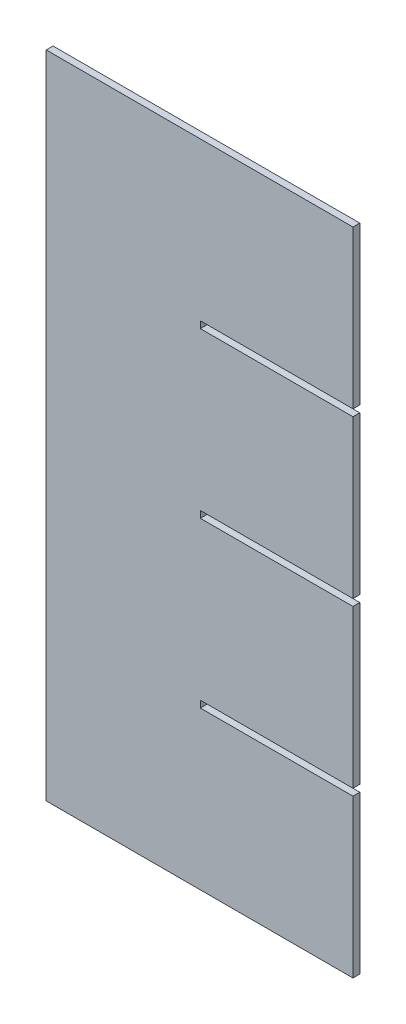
ISO-10303-21;
HEADER;
FILE_DESCRIPTION(('STEP AP214'),'2;1');
FILE_NAME('part.step','',(''),(''),'','','');
FILE_SCHEMA(('AUTOMOTIVE_DESIGN { 1 0 10303 214 1 1 1 1 }'));
ENDSEC;
DATA;
#1=APPLICATION_CONTEXT('core data for automotive mechanical design processes');
#2=APPLICATION_PROTOCOL_DEFINITION('international standard','automotive_design',2000,#1);
#3=PRODUCT_CONTEXT('',#1,'mechanical');
#4=PRODUCT('Part','Part','',(#3));
#5=PRODUCT_RELATED_PRODUCT_CATEGORY('part','',(#4));
#6=PRODUCT_DEFINITION_FORMATION('','',#4);
#7=PRODUCT_DEFINITION_CONTEXT('part definition',#1,'design');
#8=PRODUCT_DEFINITION('design','',#6,#7);
#9=PRODUCT_DEFINITION_SHAPE('','',#8);
#10=(LENGTH_UNIT() NAMED_UNIT(*) SI_UNIT(.MILLI.,.METRE.));
#11=(NAMED_UNIT(*) PLANE_ANGLE_UNIT() SI_UNIT($,.RADIAN.));
#12=(NAMED_UNIT(*) SI_UNIT($,.STERADIAN.) SOLID_ANGLE_UNIT());
#13=UNCERTAINTY_MEASURE_WITH_UNIT(LENGTH_MEASURE(1.E-05),#10,'distance_accuracy_value','');
#14=(GEOMETRIC_REPRESENTATION_CONTEXT(3) GLOBAL_UNCERTAINTY_ASSIGNED_CONTEXT((#13)) GLOBAL_UNIT_ASSIGNED_CONTEXT((#10,
#11,#12)) REPRESENTATION_CONTEXT('',''));
#15=CARTESIAN_POINT('',(0.,0.,0.));
#16=DIRECTION('',(0.,0.,1.));
#17=DIRECTION('',(1.,0.,0.));
#18=AXIS2_PLACEMENT_3D('',#15,#16,#17);
#19=CARTESIAN_POINT('',(6.10622663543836E-13,339.852,3.556));
#20=DIRECTION('',(1.,0.,0.));
#21=DIRECTION('',(0.,1.,0.));
#22=AXIS2_PLACEMENT_3D('',#19,#20,#21);
#23=PLANE('',#22);
#24=DIRECTION('',(0.,-1.,0.));
#25=VECTOR('',#24,1.);
#26=CARTESIAN_POINT('',(6.10622663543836E-13,339.852,0.));
#27=LINE('',#26,#25);
#28=CARTESIAN_POINT('',(6.10622663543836E-13,339.852,0.));
#29=VERTEX_POINT('',#28);
#30=CARTESIAN_POINT('',(0.,0.,0.));
#31=VERTEX_POINT('',#30);
#32=EDGE_CURVE('E177',#29,#31,#27,.T.);
#33=ORIENTED_EDGE('',*,*,#32,.T.);
#34=DIRECTION('',(0.,0.,-1.));
#35=VECTOR('',#34,1.);
#36=CARTESIAN_POINT('',(0.,0.,3.556));
#37=LINE('',#36,#35);
#38=CARTESIAN_POINT('',(0.,0.,3.556));
#39=VERTEX_POINT('',#38);
#40=EDGE_CURVE('E11',#39,#31,#37,.T.);
#41=ORIENTED_EDGE('',*,*,#40,.F.);
#42=DIRECTION('',(0.,-1.,0.));
#43=VECTOR('',#42,1.);
#44=CARTESIAN_POINT('',(6.10622663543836E-13,339.852,3.556));
#45=LINE('',#44,#43);
#46=CARTESIAN_POINT('',(6.10622663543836E-13,339.852,3.556));
#47=VERTEX_POINT('',#46);
#48=EDGE_CURVE('E207',#47,#39,#45,.T.);
#49=ORIENTED_EDGE('',*,*,#48,.F.);
#50=DIRECTION('',(0.,0.,-1.));
#51=VECTOR('',#50,1.);
#52=CARTESIAN_POINT('',(6.10622663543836E-13,339.852,3.556));
#53=LINE('',#52,#51);
#54=EDGE_CURVE('E173',#47,#29,#53,.T.);
#55=ORIENTED_EDGE('',*,*,#54,.T.);
#56=EDGE_LOOP('',(#33,#41,#49,#55));
#57=FACE_BOUND('',#56,.T.);
#58=ADVANCED_FACE('F33',(#57),#23,.F.);
#59=CARTESIAN_POINT('',(0.,0.,3.556));
#60=DIRECTION('',(0.,1.,0.));
#61=DIRECTION('',(0.,0.,1.));
#62=AXIS2_PLACEMENT_3D('',#59,#60,#61);
#63=PLANE('',#62);
#64=DIRECTION('',(1.,0.,0.));
#65=VECTOR('',#64,1.);
#66=CARTESIAN_POINT('',(0.,0.,0.));
#67=LINE('',#66,#65);
#68=CARTESIAN_POINT('',(160.274,0.,0.));
#69=VERTEX_POINT('',#68);
#70=EDGE_CURVE('E180',#31,#69,#67,.T.);
#71=ORIENTED_EDGE('',*,*,#70,.T.);
#72=DIRECTION('',(0.,0.,-1.));
#73=VECTOR('',#72,1.);
#74=CARTESIAN_POINT('',(160.274,0.,3.556));
#75=LINE('',#74,#73);
#76=CARTESIAN_POINT('',(160.274,0.,3.556));
#77=VERTEX_POINT('',#76);
#78=EDGE_CURVE('E41',#77,#69,#75,.T.);
#79=ORIENTED_EDGE('',*,*,#78,.F.);
#80=DIRECTION('',(1.,0.,0.));
#81=VECTOR('',#80,1.);
#82=CARTESIAN_POINT('',(0.,0.,3.556));
#83=LINE('',#82,#81);
#84=EDGE_CURVE('E116',#39,#77,#83,.T.);
#85=ORIENTED_EDGE('',*,*,#84,.F.);
#86=ORIENTED_EDGE('',*,*,#40,.T.);
#87=EDGE_LOOP('',(#71,#79,#85,#86));
#88=FACE_BOUND('',#87,.T.);
#89=ADVANCED_FACE('F305',(#88),#63,.F.);
#90=CARTESIAN_POINT('',(160.274,0.,3.556));
#91=DIRECTION('',(-1.,0.,0.));
#92=DIRECTION('',(0.,0.,1.));
#93=AXIS2_PLACEMENT_3D('',#90,#91,#92);
#94=PLANE('',#93);
#95=DIRECTION('',(0.,1.,0.));
#96=VECTOR('',#95,1.);
#97=CARTESIAN_POINT('',(160.274,0.,0.));
#98=LINE('',#97,#96);
#99=CARTESIAN_POINT('',(160.274,82.296,0.));
#100=VERTEX_POINT('',#99);
#101=EDGE_CURVE('E182',#69,#100,#98,.T.);
#102=ORIENTED_EDGE('',*,*,#101,.T.);
#103=DIRECTION('',(0.,0.,-1.));
#104=VECTOR('',#103,1.);
#105=CARTESIAN_POINT('',(160.274,82.296,3.556));
#106=LINE('',#105,#104);
#107=CARTESIAN_POINT('',(160.274,82.296,3.556));
#108=VERTEX_POINT('',#107);
#109=EDGE_CURVE('E238',#108,#100,#106,.T.);
#110=ORIENTED_EDGE('',*,*,#109,.F.);
#111=DIRECTION('',(0.,1.,0.));
#112=VECTOR('',#111,1.);
#113=CARTESIAN_POINT('',(160.274,0.,3.556));
#114=LINE('',#113,#112);
#115=EDGE_CURVE('E246',#77,#108,#114,.T.);
#116=ORIENTED_EDGE('',*,*,#115,.F.);
#117=ORIENTED_EDGE('',*,*,#78,.T.);
#118=EDGE_LOOP('',(#102,#110,#116,#117));
#119=FACE_BOUND('',#118,.T.);
#120=ADVANCED_FACE('F244',(#119),#94,.F.);
#121=CARTESIAN_POINT('',(160.274,82.296,3.556));
#122=DIRECTION('',(0.,-1.,0.));
#123=DIRECTION('',(1.,0.,0.));
#124=AXIS2_PLACEMENT_3D('',#121,#122,#123);
#125=PLANE('',#124);
#126=DIRECTION('',(-1.,0.,0.));
#127=VECTOR('',#126,1.);
#128=CARTESIAN_POINT('',(160.274,82.296,0.));
#129=LINE('',#128,#127);
#130=CARTESIAN_POINT('',(80.518,82.296,0.));
#131=VERTEX_POINT('',#130);
#132=EDGE_CURVE('E184',#100,#131,#129,.T.);
#133=ORIENTED_EDGE('',*,*,#132,.T.);
#134=DIRECTION('',(0.,0.,-1.));
#135=VECTOR('',#134,1.);
#136=CARTESIAN_POINT('',(80.518,82.296,3.556));
#137=LINE('',#136,#135);
#138=CARTESIAN_POINT('',(80.518,82.296,3.556));
#139=VERTEX_POINT('',#138);
#140=EDGE_CURVE('E235',#139,#131,#137,.T.);
#141=ORIENTED_EDGE('',*,*,#140,.F.);
#142=DIRECTION('',(-1.,0.,0.));
#143=VECTOR('',#142,1.);
#144=CARTESIAN_POINT('',(160.274,82.296,3.556));
#145=LINE('',#144,#143);
#146=EDGE_CURVE('E264',#108,#139,#145,.T.);
#147=ORIENTED_EDGE('',*,*,#146,.F.);
#148=ORIENTED_EDGE('',*,*,#109,.T.);
#149=EDGE_LOOP('',(#133,#141,#147,#148));
#150=FACE_BOUND('',#149,.T.);
#151=ADVANCED_FACE('F255',(#150),#125,.F.);
#152=CARTESIAN_POINT('',(80.518,82.296,3.556));
#153=DIRECTION('',(-1.,0.,0.));
#154=DIRECTION('',(0.,0.,1.));
#155=AXIS2_PLACEMENT_3D('',#152,#153,#154);
#156=PLANE('',#155);
#157=DIRECTION('',(0.,1.,0.));
#158=VECTOR('',#157,1.);
#159=CARTESIAN_POINT('',(80.518,82.296,0.));
#160=LINE('',#159,#158);
#161=CARTESIAN_POINT('',(80.518,85.852,0.));
#162=VERTEX_POINT('',#161);
#163=EDGE_CURVE('E186',#131,#162,#160,.T.);
#164=ORIENTED_EDGE('',*,*,#163,.T.);
#165=DIRECTION('',(0.,0.,-1.));
#166=VECTOR('',#165,1.);
#167=CARTESIAN_POINT('',(80.518,85.852,3.556));
#168=LINE('',#167,#166);
#169=CARTESIAN_POINT('',(80.518,85.852,3.556));
#170=VERTEX_POINT('',#169);
#171=EDGE_CURVE('E232',#170,#162,#168,.T.);
#172=ORIENTED_EDGE('',*,*,#171,.F.);
#173=DIRECTION('',(0.,1.,0.));
#174=VECTOR('',#173,1.);
#175=CARTESIAN_POINT('',(80.518,82.296,3.556));
#176=LINE('',#175,#174);
#177=EDGE_CURVE('E261',#139,#170,#176,.T.);
#178=ORIENTED_EDGE('',*,*,#177,.F.);
#179=ORIENTED_EDGE('',*,*,#140,.T.);
#180=EDGE_LOOP('',(#164,#172,#178,#179));
#181=FACE_BOUND('',#180,.T.);
#182=ADVANCED_FACE('F259',(#181),#156,.F.);
#183=CARTESIAN_POINT('',(80.518,85.852,3.556));
#184=DIRECTION('',(0.,1.,0.));
#185=DIRECTION('',(-1.,0.,0.));
#186=AXIS2_PLACEMENT_3D('',#183,#184,#185);
#187=PLANE('',#186);
#188=DIRECTION('',(1.,0.,0.));
#189=VECTOR('',#188,1.);
#190=CARTESIAN_POINT('',(80.518,85.852,0.));
#191=LINE('',#190,#189);
#192=CARTESIAN_POINT('',(160.274,85.852,0.));
#193=VERTEX_POINT('',#192);
#194=EDGE_CURVE('E188',#162,#193,#191,.T.);
#195=ORIENTED_EDGE('',*,*,#194,.T.);
#196=DIRECTION('',(0.,0.,-1.));
#197=VECTOR('',#196,1.);
#198=CARTESIAN_POINT('',(160.274,85.852,3.556));
#199=LINE('',#198,#197);
#200=CARTESIAN_POINT('',(160.274,85.852,3.556));
#201=VERTEX_POINT('',#200);
#202=EDGE_CURVE('E229',#201,#193,#199,.T.);
#203=ORIENTED_EDGE('',*,*,#202,.F.);
#204=DIRECTION('',(1.,0.,0.));
#205=VECTOR('',#204,1.);
#206=CARTESIAN_POINT('',(80.518,85.852,3.556));
#207=LINE('',#206,#205);
#208=EDGE_CURVE('E263',#170,#201,#207,.T.);
#209=ORIENTED_EDGE('',*,*,#208,.F.);
#210=ORIENTED_EDGE('',*,*,#171,.T.);
#211=EDGE_LOOP('',(#195,#203,#209,#210));
#212=FACE_BOUND('',#211,.T.);
#213=ADVANCED_FACE('F318',(#212),#187,.F.);
#214=CARTESIAN_POINT('',(160.274,85.852,3.556));
#215=DIRECTION('',(-1.,0.,0.));
#216=DIRECTION('',(0.,0.,1.));
#217=AXIS2_PLACEMENT_3D('',#214,#215,#216);
#218=PLANE('',#217);
#219=DIRECTION('',(0.,1.,0.));
#220=VECTOR('',#219,1.);
#221=CARTESIAN_POINT('',(160.274,85.852,0.));
#222=LINE('',#221,#220);
#223=CARTESIAN_POINT('',(160.274,168.148,0.));
#224=VERTEX_POINT('',#223);
#225=EDGE_CURVE('E190',#193,#224,#222,.T.);
#226=ORIENTED_EDGE('',*,*,#225,.T.);
#227=DIRECTION('',(0.,0.,-1.));
#228=VECTOR('',#227,1.);
#229=CARTESIAN_POINT('',(160.274,168.148,3.556));
#230=LINE('',#229,#228);
#231=CARTESIAN_POINT('',(160.274,168.148,3.556));
#232=VERTEX_POINT('',#231);
#233=EDGE_CURVE('E226',#232,#224,#230,.T.);
#234=ORIENTED_EDGE('',*,*,#233,.F.);
#235=DIRECTION('',(0.,1.,0.));
#236=VECTOR('',#235,1.);
#237=CARTESIAN_POINT('',(160.274,85.852,3.556));
#238=LINE('',#237,#236);
#239=EDGE_CURVE('E266',#201,#232,#238,.T.);
#240=ORIENTED_EDGE('',*,*,#239,.F.);
#241=ORIENTED_EDGE('',*,*,#202,.T.);
#242=EDGE_LOOP('',(#226,#234,#240,#241));
#243=FACE_BOUND('',#242,.T.);
#244=ADVANCED_FACE('F321',(#243),#218,.F.);
#245=CARTESIAN_POINT('',(160.274,168.148,3.556));
#246=DIRECTION('',(0.,-1.,0.));
#247=DIRECTION('',(1.,0.,0.));
#248=AXIS2_PLACEMENT_3D('',#245,#246,#247);
#249=PLANE('',#248);
#250=DIRECTION('',(-1.,0.,0.));
#251=VECTOR('',#250,1.);
#252=CARTESIAN_POINT('',(160.274,168.148,0.));
#253=LINE('',#252,#251);
#254=CARTESIAN_POINT('',(80.5180000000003,168.148,0.));
#255=VERTEX_POINT('',#254);
#256=EDGE_CURVE('E192',#224,#255,#253,.T.);
#257=ORIENTED_EDGE('',*,*,#256,.T.);
#258=DIRECTION('',(0.,0.,-1.));
#259=VECTOR('',#258,1.);
#260=CARTESIAN_POINT('',(80.5180000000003,168.148,3.556));
#261=LINE('',#260,#259);
#262=CARTESIAN_POINT('',(80.5180000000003,168.148,3.556));
#263=VERTEX_POINT('',#262);
#264=EDGE_CURVE('E223',#263,#255,#261,.T.);
#265=ORIENTED_EDGE('',*,*,#264,.F.);
#266=DIRECTION('',(-1.,0.,0.));
#267=VECTOR('',#266,1.);
#268=CARTESIAN_POINT('',(160.274,168.148,3.556));
#269=LINE('',#268,#267);
#270=EDGE_CURVE('E272',#232,#263,#269,.T.);
#271=ORIENTED_EDGE('',*,*,#270,.F.);
#272=ORIENTED_EDGE('',*,*,#233,.T.);
#273=EDGE_LOOP('',(#257,#265,#271,#272));
#274=FACE_BOUND('',#273,.T.);
#275=ADVANCED_FACE('F325',(#274),#249,.F.);
#276=CARTESIAN_POINT('',(80.5180000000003,168.148,3.556));
#277=DIRECTION('',(-1.,0.,0.));
#278=DIRECTION('',(0.,0.,1.));
#279=AXIS2_PLACEMENT_3D('',#276,#277,#278);
#280=PLANE('',#279);
#281=DIRECTION('',(0.,1.,0.));
#282=VECTOR('',#281,1.);
#283=CARTESIAN_POINT('',(80.5180000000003,168.148,0.));
#284=LINE('',#283,#282);
#285=CARTESIAN_POINT('',(80.5180000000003,171.704,0.));
#286=VERTEX_POINT('',#285);
#287=EDGE_CURVE('E194',#255,#286,#284,.T.);
#288=ORIENTED_EDGE('',*,*,#287,.T.);
#289=DIRECTION('',(0.,0.,-1.));
#290=VECTOR('',#289,1.);
#291=CARTESIAN_POINT('',(80.5180000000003,171.704,3.556));
#292=LINE('',#291,#290);
#293=CARTESIAN_POINT('',(80.5180000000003,171.704,3.556));
#294=VERTEX_POINT('',#293);
#295=EDGE_CURVE('E220',#294,#286,#292,.T.);
#296=ORIENTED_EDGE('',*,*,#295,.F.);
#297=DIRECTION('',(0.,1.,0.));
#298=VECTOR('',#297,1.);
#299=CARTESIAN_POINT('',(80.5180000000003,168.148,3.556));
#300=LINE('',#299,#298);
#301=EDGE_CURVE('E274',#263,#294,#300,.T.);
#302=ORIENTED_EDGE('',*,*,#301,.F.);
#303=ORIENTED_EDGE('',*,*,#264,.T.);
#304=EDGE_LOOP('',(#288,#296,#302,#303));
#305=FACE_BOUND('',#304,.T.);
#306=ADVANCED_FACE('F329',(#305),#280,.F.);
#307=CARTESIAN_POINT('',(80.5180000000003,171.704,3.556));
#308=DIRECTION('',(0.,1.,0.));
#309=DIRECTION('',(-1.,0.,0.));
#310=AXIS2_PLACEMENT_3D('',#307,#308,#309);
#311=PLANE('',#310);
#312=DIRECTION('',(1.,0.,0.));
#313=VECTOR('',#312,1.);
#314=CARTESIAN_POINT('',(80.5180000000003,171.704,0.));
#315=LINE('',#314,#313);
#316=CARTESIAN_POINT('',(160.274,171.704,0.));
#317=VERTEX_POINT('',#316);
#318=EDGE_CURVE('E196',#286,#317,#315,.T.);
#319=ORIENTED_EDGE('',*,*,#318,.T.);
#320=DIRECTION('',(0.,0.,-1.));
#321=VECTOR('',#320,1.);
#322=CARTESIAN_POINT('',(160.274,171.704,3.556));
#323=LINE('',#322,#321);
#324=CARTESIAN_POINT('',(160.274,171.704,3.556));
#325=VERTEX_POINT('',#324);
#326=EDGE_CURVE('E217',#325,#317,#323,.T.);
#327=ORIENTED_EDGE('',*,*,#326,.F.);
#328=DIRECTION('',(1.,0.,0.));
#329=VECTOR('',#328,1.);
#330=CARTESIAN_POINT('',(80.5180000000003,171.704,3.556));
#331=LINE('',#330,#329);
#332=EDGE_CURVE('E276',#294,#325,#331,.T.);
#333=ORIENTED_EDGE('',*,*,#332,.F.);
#334=ORIENTED_EDGE('',*,*,#295,.T.);
#335=EDGE_LOOP('',(#319,#327,#333,#334));
#336=FACE_BOUND('',#335,.T.);
#337=ADVANCED_FACE('F333',(#336),#311,.F.);
#338=CARTESIAN_POINT('',(160.274,171.704,3.556));
#339=DIRECTION('',(-1.,0.,0.));
#340=DIRECTION('',(0.,0.,1.));
#341=AXIS2_PLACEMENT_3D('',#338,#339,#340);
#342=PLANE('',#341);
#343=DIRECTION('',(0.,1.,0.));
#344=VECTOR('',#343,1.);
#345=CARTESIAN_POINT('',(160.274,171.704,0.));
#346=LINE('',#345,#344);
#347=CARTESIAN_POINT('',(160.274,254.,0.));
#348=VERTEX_POINT('',#347);
#349=EDGE_CURVE('E198',#317,#348,#346,.T.);
#350=ORIENTED_EDGE('',*,*,#349,.T.);
#351=DIRECTION('',(0.,0.,-1.));
#352=VECTOR('',#351,1.);
#353=CARTESIAN_POINT('',(160.274,254.,3.556));
#354=LINE('',#353,#352);
#355=CARTESIAN_POINT('',(160.274,254.,3.556));
#356=VERTEX_POINT('',#355);
#357=EDGE_CURVE('E214',#356,#348,#354,.T.);
#358=ORIENTED_EDGE('',*,*,#357,.F.);
#359=DIRECTION('',(0.,1.,0.));
#360=VECTOR('',#359,1.);
#361=CARTESIAN_POINT('',(160.274,171.704,3.556));
#362=LINE('',#361,#360);
#363=EDGE_CURVE('E278',#325,#356,#362,.T.);
#364=ORIENTED_EDGE('',*,*,#363,.F.);
#365=ORIENTED_EDGE('',*,*,#326,.T.);
#366=EDGE_LOOP('',(#350,#358,#364,#365));
#367=FACE_BOUND('',#366,.T.);
#368=ADVANCED_FACE('F337',(#367),#342,.F.);
#369=CARTESIAN_POINT('',(160.274,254.,3.556));
#370=DIRECTION('',(0.,-1.,0.));
#371=DIRECTION('',(0.,0.,-1.));
#372=AXIS2_PLACEMENT_3D('',#369,#370,#371);
#373=PLANE('',#372);
#374=DIRECTION('',(-1.,0.,0.));
#375=VECTOR('',#374,1.);
#376=CARTESIAN_POINT('',(160.274,254.,0.));
#377=LINE('',#376,#375);
#378=CARTESIAN_POINT('',(80.5180000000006,254.,0.));
#379=VERTEX_POINT('',#378);
#380=EDGE_CURVE('E200',#348,#379,#377,.T.);
#381=ORIENTED_EDGE('',*,*,#380,.T.);
#382=DIRECTION('',(0.,0.,-1.));
#383=VECTOR('',#382,1.);
#384=CARTESIAN_POINT('',(80.5180000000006,254.,3.556));
#385=LINE('',#384,#383);
#386=CARTESIAN_POINT('',(80.5180000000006,254.,3.556));
#387=VERTEX_POINT('',#386);
#388=EDGE_CURVE('E211',#387,#379,#385,.T.);
#389=ORIENTED_EDGE('',*,*,#388,.F.);
#390=DIRECTION('',(-1.,0.,0.));
#391=VECTOR('',#390,1.);
#392=CARTESIAN_POINT('',(160.274,254.,3.556));
#393=LINE('',#392,#391);
#394=EDGE_CURVE('E280',#356,#387,#393,.T.);
#395=ORIENTED_EDGE('',*,*,#394,.F.);
#396=ORIENTED_EDGE('',*,*,#357,.T.);
#397=EDGE_LOOP('',(#381,#389,#395,#396));
#398=FACE_BOUND('',#397,.T.);
#399=ADVANCED_FACE('F286',(#398),#373,.F.);
#400=CARTESIAN_POINT('',(80.5180000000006,254.,3.556));
#401=DIRECTION('',(-1.,0.,0.));
#402=DIRECTION('',(0.,0.,1.));
#403=AXIS2_PLACEMENT_3D('',#400,#401,#402);
#404=PLANE('',#403);
#405=DIRECTION('',(0.,1.,0.));
#406=VECTOR('',#405,1.);
#407=CARTESIAN_POINT('',(80.5180000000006,254.,0.));
#408=LINE('',#407,#406);
#409=CARTESIAN_POINT('',(80.5180000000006,257.556,0.));
#410=VERTEX_POINT('',#409);
#411=EDGE_CURVE('E202',#379,#410,#408,.T.);
#412=ORIENTED_EDGE('',*,*,#411,.T.);
#413=DIRECTION('',(0.,0.,-1.));
#414=VECTOR('',#413,1.);
#415=CARTESIAN_POINT('',(80.5180000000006,257.556,3.556));
#416=LINE('',#415,#414);
#417=CARTESIAN_POINT('',(80.5180000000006,257.556,3.556));
#418=VERTEX_POINT('',#417);
#419=EDGE_CURVE('E168',#418,#410,#416,.T.);
#420=ORIENTED_EDGE('',*,*,#419,.F.);
#421=DIRECTION('',(0.,1.,0.));
#422=VECTOR('',#421,1.);
#423=CARTESIAN_POINT('',(80.5180000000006,254.,3.556));
#424=LINE('',#423,#422);
#425=EDGE_CURVE('E159',#387,#418,#424,.T.);
#426=ORIENTED_EDGE('',*,*,#425,.F.);
#427=ORIENTED_EDGE('',*,*,#388,.T.);
#428=EDGE_LOOP('',(#412,#420,#426,#427));
#429=FACE_BOUND('',#428,.T.);
#430=ADVANCED_FACE('F290',(#429),#404,.F.);
#431=CARTESIAN_POINT('',(80.5180000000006,257.556,3.556));
#432=DIRECTION('',(0.,1.,0.));
#433=DIRECTION('',(0.,0.,1.));
#434=AXIS2_PLACEMENT_3D('',#431,#432,#433);
#435=PLANE('',#434);
#436=DIRECTION('',(1.,0.,0.));
#437=VECTOR('',#436,1.);
#438=CARTESIAN_POINT('',(80.5180000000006,257.556,0.));
#439=LINE('',#438,#437);
#440=CARTESIAN_POINT('',(160.274000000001,257.556,0.));
#441=VERTEX_POINT('',#440);
#442=EDGE_CURVE('E167',#410,#441,#439,.T.);
#443=ORIENTED_EDGE('',*,*,#442,.T.);
#444=DIRECTION('',(0.,0.,-1.));
#445=VECTOR('',#444,1.);
#446=CARTESIAN_POINT('',(160.274000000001,257.556,3.556));
#447=LINE('',#446,#445);
#448=CARTESIAN_POINT('',(160.274000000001,257.556,3.556));
#449=VERTEX_POINT('',#448);
#450=EDGE_CURVE('E164',#449,#441,#447,.T.);
#451=ORIENTED_EDGE('',*,*,#450,.F.);
#452=DIRECTION('',(1.,0.,0.));
#453=VECTOR('',#452,1.);
#454=CARTESIAN_POINT('',(80.5180000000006,257.556,3.556));
#455=LINE('',#454,#453);
#456=EDGE_CURVE('E153',#418,#449,#455,.T.);
#457=ORIENTED_EDGE('',*,*,#456,.F.);
#458=ORIENTED_EDGE('',*,*,#419,.T.);
#459=EDGE_LOOP('',(#443,#451,#457,#458));
#460=FACE_BOUND('',#459,.T.);
#461=ADVANCED_FACE('F165',(#460),#435,.F.);
#462=CARTESIAN_POINT('',(160.274000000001,257.556,3.556));
#463=DIRECTION('',(-1.,0.,0.));
#464=DIRECTION('',(0.,0.,1.));
#465=AXIS2_PLACEMENT_3D('',#462,#463,#464);
#466=PLANE('',#465);
#467=DIRECTION('',(0.,1.,0.));
#468=VECTOR('',#467,1.);
#469=CARTESIAN_POINT('',(160.274000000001,257.556,0.));
#470=LINE('',#469,#468);
#471=CARTESIAN_POINT('',(160.274000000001,339.852,0.));
#472=VERTEX_POINT('',#471);
#473=EDGE_CURVE('E102',#441,#472,#470,.T.);
#474=ORIENTED_EDGE('',*,*,#473,.T.);
#475=DIRECTION('',(0.,0.,-1.));
#476=VECTOR('',#475,1.);
#477=CARTESIAN_POINT('',(160.274000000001,339.852,3.556));
#478=LINE('',#477,#476);
#479=CARTESIAN_POINT('',(160.274000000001,339.852,3.556));
#480=VERTEX_POINT('',#479);
#481=EDGE_CURVE('E169',#480,#472,#478,.T.);
#482=ORIENTED_EDGE('',*,*,#481,.F.);
#483=DIRECTION('',(0.,1.,0.));
#484=VECTOR('',#483,1.);
#485=CARTESIAN_POINT('',(160.274000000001,257.556,3.556));
#486=LINE('',#485,#484);
#487=EDGE_CURVE('E157',#449,#480,#486,.T.);
#488=ORIENTED_EDGE('',*,*,#487,.F.);
#489=ORIENTED_EDGE('',*,*,#450,.T.);
#490=EDGE_LOOP('',(#474,#482,#488,#489));
#491=FACE_BOUND('',#490,.T.);
#492=ADVANCED_FACE('F171',(#491),#466,.F.);
#493=CARTESIAN_POINT('',(160.274000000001,339.852,3.556));
#494=DIRECTION('',(0.,-1.,0.));
#495=DIRECTION('',(1.,0.,0.));
#496=AXIS2_PLACEMENT_3D('',#493,#494,#495);
#497=PLANE('',#496);
#498=DIRECTION('',(-1.,0.,0.));
#499=VECTOR('',#498,1.);
#500=CARTESIAN_POINT('',(160.274000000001,339.852,0.));
#501=LINE('',#500,#499);
#502=EDGE_CURVE('E108',#472,#29,#501,.T.);
#503=ORIENTED_EDGE('',*,*,#502,.T.);
#504=ORIENTED_EDGE('',*,*,#54,.F.);
#505=DIRECTION('',(-1.,0.,0.));
#506=VECTOR('',#505,1.);
#507=CARTESIAN_POINT('',(160.274000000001,339.852,3.556));
#508=LINE('',#507,#506);
#509=EDGE_CURVE('E49',#480,#47,#508,.T.);
#510=ORIENTED_EDGE('',*,*,#509,.F.);
#511=ORIENTED_EDGE('',*,*,#481,.T.);
#512=EDGE_LOOP('',(#503,#504,#510,#511));
#513=FACE_BOUND('',#512,.T.);
#514=ADVANCED_FACE('F294',(#513),#497,.F.);
#515=CARTESIAN_POINT('',(0.,0.,3.556));
#516=DIRECTION('',(0.,0.,1.));
#517=DIRECTION('',(1.,0.,0.));
#518=AXIS2_PLACEMENT_3D('',#515,#516,#517);
#519=PLANE('',#518);
#520=ORIENTED_EDGE('',*,*,#48,.T.);
#521=ORIENTED_EDGE('',*,*,#84,.T.);
#522=ORIENTED_EDGE('',*,*,#115,.T.);
#523=ORIENTED_EDGE('',*,*,#146,.T.);
#524=ORIENTED_EDGE('',*,*,#177,.T.);
#525=ORIENTED_EDGE('',*,*,#208,.T.);
#526=ORIENTED_EDGE('',*,*,#239,.T.);
#527=ORIENTED_EDGE('',*,*,#270,.T.);
#528=ORIENTED_EDGE('',*,*,#301,.T.);
#529=ORIENTED_EDGE('',*,*,#332,.T.);
#530=ORIENTED_EDGE('',*,*,#363,.T.);
#531=ORIENTED_EDGE('',*,*,#394,.T.);
#532=ORIENTED_EDGE('',*,*,#425,.T.);
#533=ORIENTED_EDGE('',*,*,#456,.T.);
#534=ORIENTED_EDGE('',*,*,#487,.T.);
#535=ORIENTED_EDGE('',*,*,#509,.T.);
#536=EDGE_LOOP('',(#520,#521,#522,#523,#524,#525,#526,#527,#528,#529,#530,#531,#532,#533,#534,#535));
#537=FACE_BOUND('',#536,.T.);
#538=ADVANCED_FACE('F155',(#537),#519,.T.);
#539=CARTESIAN_POINT('',(0.,0.,0.));
#540=DIRECTION('',(0.,0.,1.));
#541=DIRECTION('',(1.,0.,0.));
#542=AXIS2_PLACEMENT_3D('',#539,#540,#541);
#543=PLANE('',#542);
#544=ORIENTED_EDGE('',*,*,#32,.F.);
#545=ORIENTED_EDGE('',*,*,#502,.F.);
#546=ORIENTED_EDGE('',*,*,#473,.F.);
#547=ORIENTED_EDGE('',*,*,#442,.F.);
#548=ORIENTED_EDGE('',*,*,#411,.F.);
#549=ORIENTED_EDGE('',*,*,#380,.F.);
#550=ORIENTED_EDGE('',*,*,#349,.F.);
#551=ORIENTED_EDGE('',*,*,#318,.F.);
#552=ORIENTED_EDGE('',*,*,#287,.F.);
#553=ORIENTED_EDGE('',*,*,#256,.F.);
#554=ORIENTED_EDGE('',*,*,#225,.F.);
#555=ORIENTED_EDGE('',*,*,#194,.F.);
#556=ORIENTED_EDGE('',*,*,#163,.F.);
#557=ORIENTED_EDGE('',*,*,#132,.F.);
#558=ORIENTED_EDGE('',*,*,#101,.F.);
#559=ORIENTED_EDGE('',*,*,#70,.F.);
#560=EDGE_LOOP('',(#544,#545,#546,#547,#548,#549,#550,#551,#552,#553,#554,#555,#556,#557,#558,#559));
#561=FACE_BOUND('',#560,.T.);
#562=ADVANCED_FACE('F250',(#561),#543,.F.);
#563=CLOSED_SHELL('',(#58,#89,#120,#151,#182,#213,#244,#275,#306,#337,#368,#399,#430,#461,#492,
#514,#538,#562));
#564=MANIFOLD_SOLID_BREP('B2',#563);
#565=ADVANCED_BREP_SHAPE_REPRESENTATION('',(#18,#564),#14);
#566=SHAPE_DEFINITION_REPRESENTATION(#9,#565);
ENDSEC;
END-ISO-10303-21;
